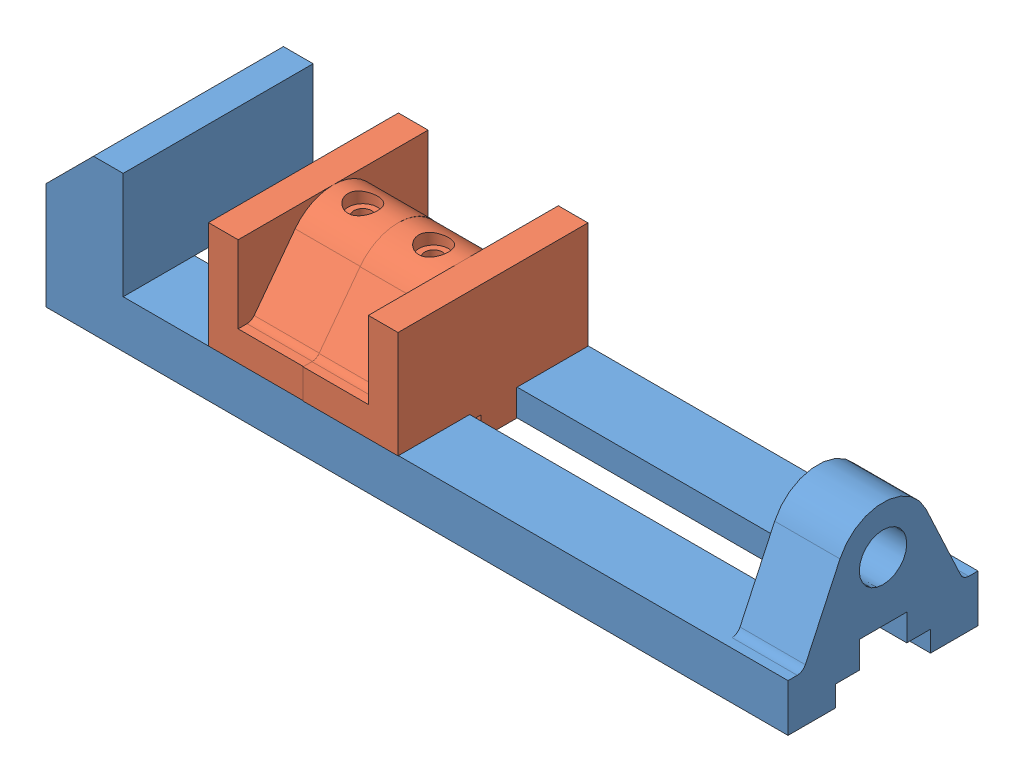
SolidWorks assembly Assem.SLDASM, configuration Default (file format 7000). Lengths in mm.
Overall size (250 52 64.14).
3 component instances, 2 part files, 3 mates.
Components (placement in the parent):
- vice-body-1: vice-body.SLDPRT [Default] at (-220.248 -14.1449 42.2069) size (250 52 64)
- vice-jaw-1: vice-jaw.SLDPRT [Default] at (-165.5136 15.8551 42.2069) x (0 0 -1) z (1 0 0) size (64 45 32)
- vice-jaw-5: vice-jaw.SLDPRT [Default] at (-101.5136 15.8551 42.3419) x (0 0 1) z (-1 0 0) size (64 45 32)
Mates (geometry in assembly coordinates):
- Coincident11: coincident anti-aligned: plane of vice-body-1 through (-220.248 -7.1449 34.2069) normal (0 0 1); plane of vice-jaw-1 through (-133.5136 1.8551 34.2069) normal (0 0 -1)
- Coincident21: coincident anti-aligned: plane of vice-body-1 through (29.752 1.8551 74.2069) normal (0 1 0); plane of vice-jaw-1 through (-133.5136 1.8551 10.2069) normal (0 -1 0)
- Parallel11: parallel anti-aligned: plane of vice-body-1 through (-194.248 1.8551 74.2069) normal (1 0 0); plane of vice-jaw-1 through (-165.5136 -7.1449 10.2069) normal (-1 0 0)
